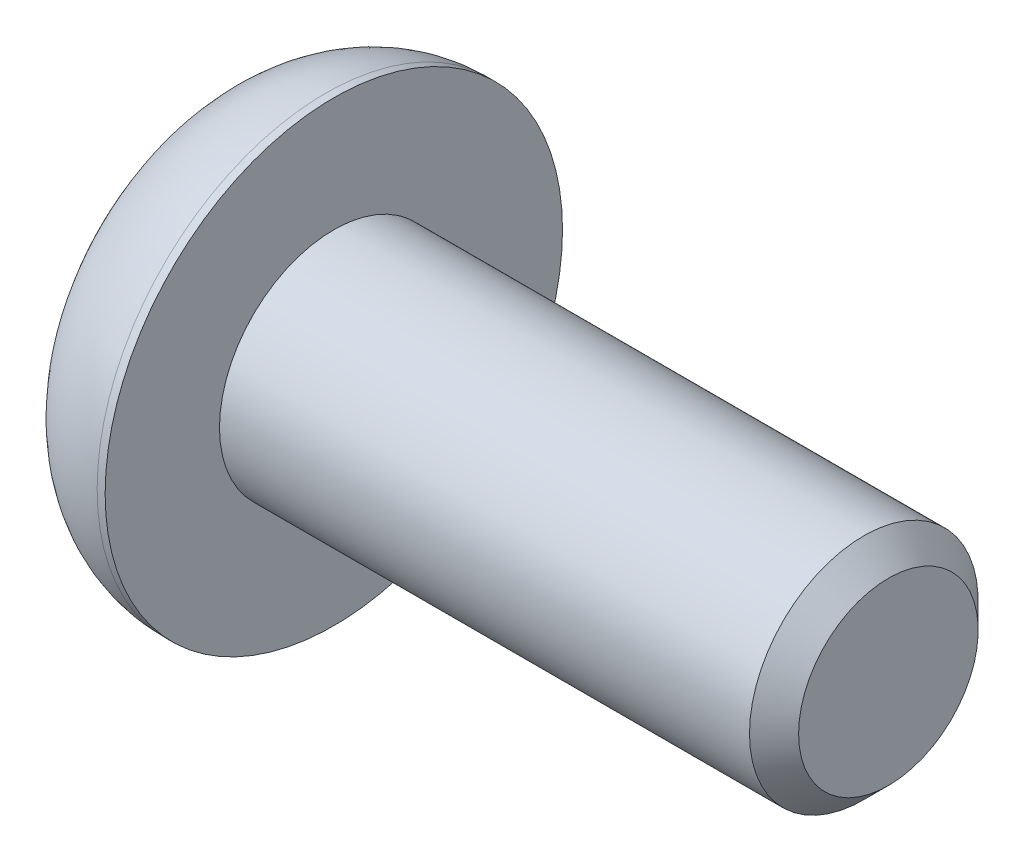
from build123d import *

# Parameters (mm, degrees)
EXTRUSION1_DEPTH = 1.495


with BuildPart() as part:
    # Esquisse1 → R_volution1 (revolve)
    with BuildSketch(Plane.XY, mode=Mode.PRIVATE) as r_volution1_sk:
        with BuildLine():
            Line((0, 0), (0, 1.84))
            ThreePointArc((0, 1.84), (0.632649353, 3.367350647), (2.16, 4))
            Line((2.16, 4), (2.3, 4))
            Line((2.3, 4), (2.3, 2))
            Line((2.3, 2), (11.5705, 2))
            Line((11.5705, 2), (12, 1.5705))
            Line((12, 1.5705), (12, 0))
            Line((12, 0), (0, 0))
        make_face()
    revolve(r_volution1_sk.sketch.rotate(Axis((12, 0, 0), (-1, 0, 0)), 270), axis=Axis((12, 0, 0), (-1, 0, 0)))

    # Esquisse2 → Extrusion1 (cut)
    with BuildSketch(Plane(origin=(0, 0, 0), x_dir=(0, 0, -1), z_dir=(1, 0, 0))):
        Polygon((-1.25, 0.721687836), (-1.25, -0.721687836), (0, -1.443375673), (1.25, -0.721687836), (1.25, 0.721687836), (0, 1.443375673), align=None)
    extrude(amount=EXTRUSION1_DEPTH, mode=Mode.SUBTRACT)

    # Esquisse3 → Enl_vement de mati_re-R_volution1 (revolve, cut)
    with BuildSketch(Plane.XY, mode=Mode.PRIVATE) as enl_vement_de_mati_re_r_volution1_sk:
        Polygon((0, 0), (0, 1.25), (1.578312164, 1.25), (2.3, 0), align=None)
    revolve(enl_vement_de_mati_re_r_volution1_sk.sketch.rotate(Axis((2.3, 0, 0), (-1, 0, 0)), 270), axis=Axis((2.3, 0, 0), (-1, 0, 0)), mode=Mode.SUBTRACT)


solid = part.part
